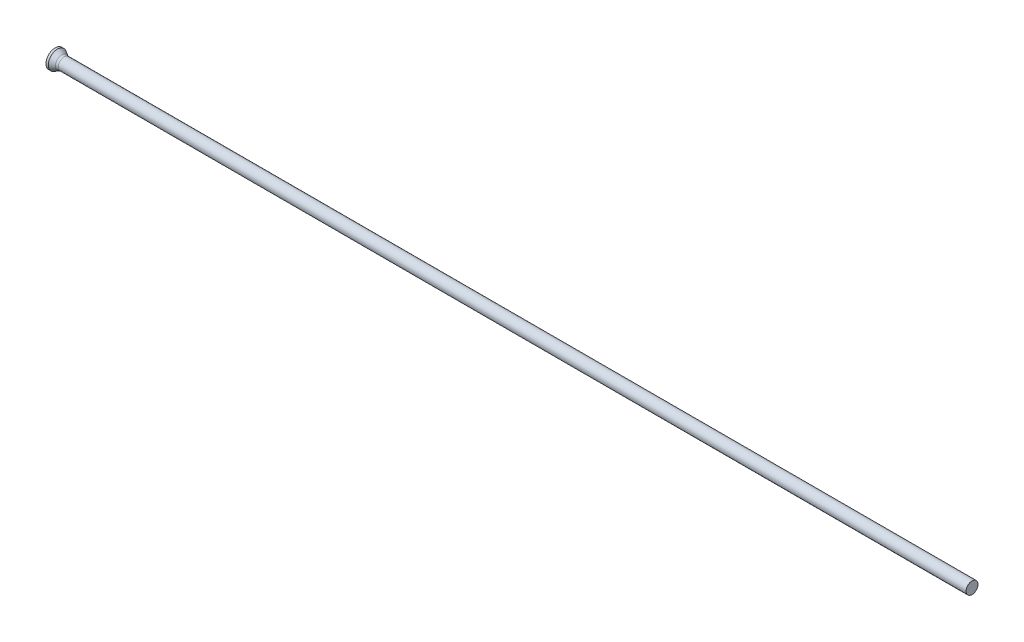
ISO-10303-21;
HEADER;
FILE_DESCRIPTION(('STEP AP214'),'2;1');
FILE_NAME('part.step','',(''),(''),'','','');
FILE_SCHEMA(('AUTOMOTIVE_DESIGN { 1 0 10303 214 1 1 1 1 }'));
ENDSEC;
DATA;
#1=APPLICATION_CONTEXT('core data for automotive mechanical design processes');
#2=APPLICATION_PROTOCOL_DEFINITION('international standard','automotive_design',2000,#1);
#3=PRODUCT_CONTEXT('',#1,'mechanical');
#4=PRODUCT('Part','Part','',(#3));
#5=PRODUCT_RELATED_PRODUCT_CATEGORY('part','',(#4));
#6=PRODUCT_DEFINITION_FORMATION('','',#4);
#7=PRODUCT_DEFINITION_CONTEXT('part definition',#1,'design');
#8=PRODUCT_DEFINITION('design','',#6,#7);
#9=PRODUCT_DEFINITION_SHAPE('','',#8);
#10=(LENGTH_UNIT() NAMED_UNIT(*) SI_UNIT(.MILLI.,.METRE.));
#11=(NAMED_UNIT(*) PLANE_ANGLE_UNIT() SI_UNIT($,.RADIAN.));
#12=(NAMED_UNIT(*) SI_UNIT($,.STERADIAN.) SOLID_ANGLE_UNIT());
#13=UNCERTAINTY_MEASURE_WITH_UNIT(LENGTH_MEASURE(1.E-05),#10,'distance_accuracy_value','');
#14=(GEOMETRIC_REPRESENTATION_CONTEXT(3) GLOBAL_UNCERTAINTY_ASSIGNED_CONTEXT((#13)) GLOBAL_UNIT_ASSIGNED_CONTEXT((#10,
#11,#12)) REPRESENTATION_CONTEXT('',''));
#15=CARTESIAN_POINT('',(0.,0.,0.));
#16=DIRECTION('',(0.,0.,1.));
#17=DIRECTION('',(1.,0.,0.));
#18=AXIS2_PLACEMENT_3D('',#15,#16,#17);
#19=CARTESIAN_POINT('',(0.,0.,0.));
#20=DIRECTION('',(1.,0.,0.));
#21=DIRECTION('',(0.,0.,-1.));
#22=AXIS2_PLACEMENT_3D('',#19,#20,#21);
#23=PLANE('',#22);
#24=CARTESIAN_POINT('',(0.,0.,0.));
#25=DIRECTION('',(-1.,0.,0.));
#26=DIRECTION('',(0.,0.,1.));
#27=AXIS2_PLACEMENT_3D('',#24,#25,#26);
#28=CIRCLE('',#27,2.);
#29=CARTESIAN_POINT('',(0.,0.,2.));
#30=VERTEX_POINT('',#29);
#31=EDGE_CURVE('E25',#30,#30,#28,.T.);
#32=ORIENTED_EDGE('',*,*,#31,.T.);
#33=EDGE_LOOP('',(#32));
#34=FACE_BOUND('',#33,.T.);
#35=ADVANCED_FACE('F14',(#34),#23,.F.);
#36=CARTESIAN_POINT('',(0.,0.,0.));
#37=DIRECTION('',(-1.,0.,0.));
#38=DIRECTION('',(0.,0.,1.));
#39=AXIS2_PLACEMENT_3D('',#36,#37,#38);
#40=CYLINDRICAL_SURFACE('',#39,2.);
#41=ORIENTED_EDGE('',*,*,#31,.F.);
#42=EDGE_LOOP('',(#41));
#43=FACE_BOUND('',#42,.T.);
#44=CARTESIAN_POINT('',(0.497564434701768,0.,0.));
#45=DIRECTION('',(-1.,0.,0.));
#46=DIRECTION('',(0.,0.,1.));
#47=AXIS2_PLACEMENT_3D('',#44,#45,#46);
#48=CIRCLE('',#47,2.);
#49=CARTESIAN_POINT('',(0.497564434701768,0.,2.));
#50=VERTEX_POINT('',#49);
#51=EDGE_CURVE('E29',#50,#50,#48,.T.);
#52=ORIENTED_EDGE('',*,*,#51,.T.);
#53=EDGE_LOOP('',(#52));
#54=FACE_BOUND('',#53,.T.);
#55=ADVANCED_FACE('F53',(#43,#54),#40,.T.);
#56=CARTESIAN_POINT('',(1.71,0.,0.));
#57=DIRECTION('',(-1.,0.,0.));
#58=DIRECTION('',(0.,0.,1.));
#59=AXIS2_PLACEMENT_3D('',#56,#57,#58);
#60=CONICAL_SURFACE('',#59,1.3,0.523598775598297);
#61=CARTESIAN_POINT('',(1.47794919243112,0.,0.));
#62=DIRECTION('',(-1.,0.,0.));
#63=DIRECTION('',(0.,0.,1.));
#64=AXIS2_PLACEMENT_3D('',#61,#62,#63);
#65=CIRCLE('',#64,1.43397459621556);
#66=CARTESIAN_POINT('',(1.47794919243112,0.,1.43397459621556));
#67=VERTEX_POINT('',#66);
#68=EDGE_CURVE('E21',#67,#67,#65,.T.);
#69=ORIENTED_EDGE('',*,*,#68,.T.);
#70=EDGE_LOOP('',(#69));
#71=FACE_BOUND('',#70,.T.);
#72=ORIENTED_EDGE('',*,*,#51,.F.);
#73=EDGE_LOOP('',(#72));
#74=FACE_BOUND('',#73,.T.);
#75=ADVANCED_FACE('F50',(#71,#74),#60,.T.);
#76=CARTESIAN_POINT('',(0.,0.,0.));
#77=DIRECTION('',(-1.,0.,0.));
#78=DIRECTION('',(0.,0.,1.));
#79=AXIS2_PLACEMENT_3D('',#76,#77,#78);
#80=CYLINDRICAL_SURFACE('',#79,1.3);
#81=CARTESIAN_POINT('',(1.97794919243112,0.,0.));
#82=DIRECTION('',(-1.,0.,0.));
#83=DIRECTION('',(0.,0.,1.));
#84=AXIS2_PLACEMENT_3D('',#81,#82,#83);
#85=CIRCLE('',#84,1.3);
#86=CARTESIAN_POINT('',(1.97794919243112,0.,1.3));
#87=VERTEX_POINT('',#86);
#88=EDGE_CURVE('E9',#87,#87,#85,.F.);
#89=ORIENTED_EDGE('',*,*,#88,.T.);
#90=EDGE_LOOP('',(#89));
#91=FACE_BOUND('',#90,.T.);
#92=CARTESIAN_POINT('',(200.,0.,0.));
#93=DIRECTION('',(-1.,0.,0.));
#94=DIRECTION('',(0.,0.,1.));
#95=AXIS2_PLACEMENT_3D('',#92,#93,#94);
#96=CIRCLE('',#95,1.3);
#97=CARTESIAN_POINT('',(200.,0.,1.3));
#98=VERTEX_POINT('',#97);
#99=EDGE_CURVE('E34',#98,#98,#96,.T.);
#100=ORIENTED_EDGE('',*,*,#99,.T.);
#101=EDGE_LOOP('',(#100));
#102=FACE_BOUND('',#101,.T.);
#103=ADVANCED_FACE('F38',(#91,#102),#80,.T.);
#104=CARTESIAN_POINT('',(200.,1.3,0.));
#105=DIRECTION('',(-1.,0.,0.));
#106=DIRECTION('',(0.,0.,1.));
#107=AXIS2_PLACEMENT_3D('',#104,#105,#106);
#108=PLANE('',#107);
#109=ORIENTED_EDGE('',*,*,#99,.F.);
#110=EDGE_LOOP('',(#109));
#111=FACE_BOUND('',#110,.T.);
#112=ADVANCED_FACE('F40',(#111),#108,.F.);
#113=CARTESIAN_POINT('',(1.97794919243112,0.,0.));
#114=DIRECTION('',(-1.,0.,0.));
#115=DIRECTION('',(0.,0.,1.));
#116=AXIS2_PLACEMENT_3D('',#113,#114,#115);
#117=TOROIDAL_SURFACE('',#116,2.3,1.);
#118=ORIENTED_EDGE('',*,*,#88,.F.);
#119=EDGE_LOOP('',(#118));
#120=FACE_BOUND('',#119,.T.);
#121=ORIENTED_EDGE('',*,*,#68,.F.);
#122=EDGE_LOOP('',(#121));
#123=FACE_BOUND('',#122,.T.);
#124=ADVANCED_FACE('F16',(#120,#123),#117,.F.);
#125=CLOSED_SHELL('',(#35,#55,#75,#103,#112,#124));
#126=MANIFOLD_SOLID_BREP('B1',#125);
#127=ADVANCED_BREP_SHAPE_REPRESENTATION('',(#18,#126),#14);
#128=SHAPE_DEFINITION_REPRESENTATION(#9,#127);
ENDSEC;
END-ISO-10303-21;
